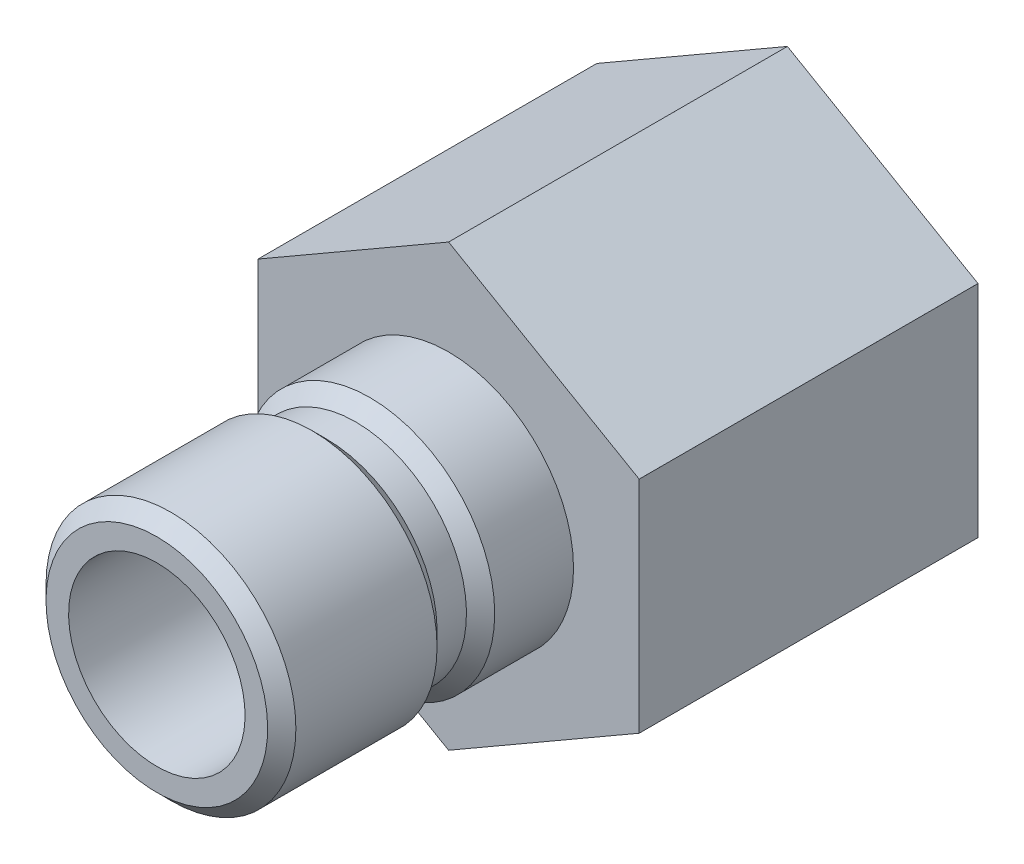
ISO-10303-21;
HEADER;
FILE_DESCRIPTION(('STEP AP214'),'2;1');
FILE_NAME('part.step','',(''),(''),'','','');
FILE_SCHEMA(('AUTOMOTIVE_DESIGN { 1 0 10303 214 1 1 1 1 }'));
ENDSEC;
DATA;
#1=APPLICATION_CONTEXT('core data for automotive mechanical design processes');
#2=APPLICATION_PROTOCOL_DEFINITION('international standard','automotive_design',2000,#1);
#3=PRODUCT_CONTEXT('',#1,'mechanical');
#4=PRODUCT('Part','Part','',(#3));
#5=PRODUCT_RELATED_PRODUCT_CATEGORY('part','',(#4));
#6=PRODUCT_DEFINITION_FORMATION('','',#4);
#7=PRODUCT_DEFINITION_CONTEXT('part definition',#1,'design');
#8=PRODUCT_DEFINITION('design','',#6,#7);
#9=PRODUCT_DEFINITION_SHAPE('','',#8);
#10=(LENGTH_UNIT() NAMED_UNIT(*) SI_UNIT(.MILLI.,.METRE.));
#11=(NAMED_UNIT(*) PLANE_ANGLE_UNIT() SI_UNIT($,.RADIAN.));
#12=(NAMED_UNIT(*) SI_UNIT($,.STERADIAN.) SOLID_ANGLE_UNIT());
#13=UNCERTAINTY_MEASURE_WITH_UNIT(LENGTH_MEASURE(1.E-05),#10,'distance_accuracy_value','');
#14=(GEOMETRIC_REPRESENTATION_CONTEXT(3) GLOBAL_UNCERTAINTY_ASSIGNED_CONTEXT((#13)) GLOBAL_UNIT_ASSIGNED_CONTEXT((#10,
#11,#12)) REPRESENTATION_CONTEXT('',''));
#15=CARTESIAN_POINT('',(0.,0.,0.));
#16=DIRECTION('',(0.,0.,1.));
#17=DIRECTION('',(1.,0.,0.));
#18=AXIS2_PLACEMENT_3D('',#15,#16,#17);
#19=CARTESIAN_POINT('',(0.,11.87831,-18.288));
#20=DIRECTION('',(0.,0.,-1.));
#21=DIRECTION('',(0.,1.,0.));
#22=AXIS2_PLACEMENT_3D('',#19,#20,#21);
#23=PLANE('',#22);
#24=CARTESIAN_POINT('',(0.,0.,-18.288));
#25=DIRECTION('',(0.,0.,-1.));
#26=DIRECTION('',(0.,1.,0.));
#27=AXIS2_PLACEMENT_3D('',#24,#25,#26);
#28=CIRCLE('',#27,6.81156341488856);
#29=CARTESIAN_POINT('',(0.,6.81156341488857,-18.288));
#30=VERTEX_POINT('',#29);
#31=EDGE_CURVE('E155',#30,#30,#28,.T.);
#32=ORIENTED_EDGE('',*,*,#31,.F.);
#33=EDGE_LOOP('',(#32));
#34=FACE_BOUND('',#33,.T.);
#35=CARTESIAN_POINT('',(0.,0.,-18.288));
#36=DIRECTION('',(0.,0.,-1.));
#37=DIRECTION('',(0.,1.,0.));
#38=AXIS2_PLACEMENT_3D('',#35,#36,#37);
#39=CIRCLE('',#38,11.87831);
#40=CARTESIAN_POINT('',(-10.287,5.93901334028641,-18.288));
#41=VERTEX_POINT('',#40);
#42=CARTESIAN_POINT('',(-10.2868364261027,5.93929665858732,-18.288));
#43=VERTEX_POINT('',#42);
#44=EDGE_CURVE('E136',#41,#43,#39,.T.);
#45=ORIENTED_EDGE('',*,*,#44,.T.);
#46=DIRECTION('',(-0.866025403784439,-0.5,0.));
#47=VECTOR('',#46,1.);
#48=CARTESIAN_POINT('',(0.,11.8784044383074,-18.288));
#49=LINE('',#48,#47);
#50=CARTESIAN_POINT('',(-0.000163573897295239,11.8783099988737,-18.288));
#51=VERTEX_POINT('',#50);
#52=EDGE_CURVE('E346',#51,#43,#49,.T.);
#53=ORIENTED_EDGE('',*,*,#52,.F.);
#54=CARTESIAN_POINT('',(0.00016357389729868,11.8783099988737,-18.288));
#55=VERTEX_POINT('',#54);
#56=EDGE_CURVE('E151',#51,#55,#39,.T.);
#57=ORIENTED_EDGE('',*,*,#56,.T.);
#58=DIRECTION('',(-0.866025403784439,0.5,0.));
#59=VECTOR('',#58,1.);
#60=CARTESIAN_POINT('',(10.287,5.93920221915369,-18.288));
#61=LINE('',#60,#59);
#62=CARTESIAN_POINT('',(10.2868364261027,5.93929665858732,-18.288));
#63=VERTEX_POINT('',#62);
#64=EDGE_CURVE('E305',#63,#55,#61,.T.);
#65=ORIENTED_EDGE('',*,*,#64,.F.);
#66=CARTESIAN_POINT('',(10.287,5.93901334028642,-18.288));
#67=VERTEX_POINT('',#66);
#68=EDGE_CURVE('E154',#63,#67,#39,.T.);
#69=ORIENTED_EDGE('',*,*,#68,.T.);
#70=DIRECTION('',(0.,1.,0.));
#71=VECTOR('',#70,1.);
#72=CARTESIAN_POINT('',(10.287,-5.93920221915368,-18.288));
#73=LINE('',#72,#71);
#74=CARTESIAN_POINT('',(10.287,-5.93901334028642,-18.288));
#75=VERTEX_POINT('',#74);
#76=EDGE_CURVE('E308',#75,#67,#73,.T.);
#77=ORIENTED_EDGE('',*,*,#76,.F.);
#78=CARTESIAN_POINT('',(10.2868364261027,-5.93929665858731,-18.288));
#79=VERTEX_POINT('',#78);
#80=EDGE_CURVE('E335',#75,#79,#39,.T.);
#81=ORIENTED_EDGE('',*,*,#80,.T.);
#82=DIRECTION('',(0.866025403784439,0.5,0.));
#83=VECTOR('',#82,1.);
#84=CARTESIAN_POINT('',(0.,-11.8784044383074,-18.288));
#85=LINE('',#84,#83);
#86=CARTESIAN_POINT('',(0.000163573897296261,-11.8783099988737,-18.288));
#87=VERTEX_POINT('',#86);
#88=EDGE_CURVE('E311',#87,#79,#85,.T.);
#89=ORIENTED_EDGE('',*,*,#88,.F.);
#90=CARTESIAN_POINT('',(-0.000163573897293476,-11.8783099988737,-18.288));
#91=VERTEX_POINT('',#90);
#92=EDGE_CURVE('E337',#87,#91,#39,.T.);
#93=ORIENTED_EDGE('',*,*,#92,.T.);
#94=DIRECTION('',(0.866025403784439,-0.5,0.));
#95=VECTOR('',#94,1.);
#96=CARTESIAN_POINT('',(-10.287,-5.93920221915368,-18.288));
#97=LINE('',#96,#95);
#98=CARTESIAN_POINT('',(-10.2868364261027,-5.93929665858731,-18.288));
#99=VERTEX_POINT('',#98);
#100=EDGE_CURVE('E348',#99,#91,#97,.T.);
#101=ORIENTED_EDGE('',*,*,#100,.F.);
#102=CARTESIAN_POINT('',(-10.287,-5.93901334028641,-18.288));
#103=VERTEX_POINT('',#102);
#104=EDGE_CURVE('E341',#99,#103,#39,.T.);
#105=ORIENTED_EDGE('',*,*,#104,.T.);
#106=DIRECTION('',(0.,-1.,0.));
#107=VECTOR('',#106,1.);
#108=CARTESIAN_POINT('',(-10.287,5.93920221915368,-18.288));
#109=LINE('',#108,#107);
#110=EDGE_CURVE('E347',#41,#103,#109,.T.);
#111=ORIENTED_EDGE('',*,*,#110,.F.);
#112=EDGE_LOOP('',(#45,#53,#57,#65,#69,#77,#81,#89,#93,#101,#105,#111));
#113=FACE_BOUND('',#112,.T.);
#114=ADVANCED_FACE('F33',(#34,#113),#23,.T.);
#115=CARTESIAN_POINT('',(0.,0.,0.));
#116=DIRECTION('',(0.,0.,-1.));
#117=DIRECTION('',(0.,1.,0.));
#118=AXIS2_PLACEMENT_3D('',#115,#116,#117);
#119=CYLINDRICAL_SURFACE('',#118,11.87831);
#120=ORIENTED_EDGE('',*,*,#56,.F.);
#121=DIRECTION('',(0.,0.,-1.));
#122=VECTOR('',#121,1.);
#123=CARTESIAN_POINT('',(-0.000163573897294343,11.8783099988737,0.));
#124=LINE('',#123,#122);
#125=CARTESIAN_POINT('',(-0.000163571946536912,11.87831,0.));
#126=VERTEX_POINT('',#125);
#127=EDGE_CURVE('E181',#51,#126,#124,.F.);
#128=ORIENTED_EDGE('',*,*,#127,.T.);
#129=CARTESIAN_POINT('',(0.,0.,0.));
#130=DIRECTION('',(0.,0.,-1.));
#131=DIRECTION('',(0.,1.,0.));
#132=AXIS2_PLACEMENT_3D('',#129,#130,#131);
#133=CIRCLE('',#132,11.87831);
#134=CARTESIAN_POINT('',(0.000163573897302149,11.8783099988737,0.));
#135=VERTEX_POINT('',#134);
#136=EDGE_CURVE('E142',#126,#135,#133,.T.);
#137=ORIENTED_EDGE('',*,*,#136,.T.);
#138=DIRECTION('',(0.,0.,-1.));
#139=VECTOR('',#138,1.);
#140=CARTESIAN_POINT('',(0.000163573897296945,11.8783099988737,0.));
#141=LINE('',#140,#139);
#142=EDGE_CURVE('E180',#135,#55,#141,.T.);
#143=ORIENTED_EDGE('',*,*,#142,.T.);
#144=EDGE_LOOP('',(#120,#128,#137,#143));
#145=FACE_BOUND('',#144,.T.);
#146=ADVANCED_FACE('F179',(#145),#119,.T.);
#147=CARTESIAN_POINT('',(-10.287,5.93901334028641,0.));
#148=VERTEX_POINT('',#147);
#149=CARTESIAN_POINT('',(-10.2868364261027,5.93929665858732,0.));
#150=VERTEX_POINT('',#149);
#151=EDGE_CURVE('E134',#148,#150,#133,.T.);
#152=ORIENTED_EDGE('',*,*,#151,.T.);
#153=DIRECTION('',(0.,0.,-1.));
#154=VECTOR('',#153,1.);
#155=CARTESIAN_POINT('',(-10.2868364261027,5.93929665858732,0.));
#156=LINE('',#155,#154);
#157=EDGE_CURVE('E48',#150,#43,#156,.T.);
#158=ORIENTED_EDGE('',*,*,#157,.T.);
#159=ORIENTED_EDGE('',*,*,#44,.F.);
#160=DIRECTION('',(0.,0.,-1.));
#161=VECTOR('',#160,1.);
#162=CARTESIAN_POINT('',(-10.287,5.93901334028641,0.));
#163=LINE('',#162,#161);
#164=EDGE_CURVE('E121',#41,#148,#163,.F.);
#165=ORIENTED_EDGE('',*,*,#164,.T.);
#166=EDGE_LOOP('',(#152,#158,#159,#165));
#167=FACE_BOUND('',#166,.T.);
#168=ADVANCED_FACE('F133',(#167),#119,.T.);
#169=ORIENTED_EDGE('',*,*,#68,.F.);
#170=DIRECTION('',(0.,0.,-1.));
#171=VECTOR('',#170,1.);
#172=CARTESIAN_POINT('',(10.2868364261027,5.93929665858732,0.));
#173=LINE('',#172,#171);
#174=CARTESIAN_POINT('',(10.2868364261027,5.93929665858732,0.));
#175=VERTEX_POINT('',#174);
#176=EDGE_CURVE('E188',#63,#175,#173,.F.);
#177=ORIENTED_EDGE('',*,*,#176,.T.);
#178=CARTESIAN_POINT('',(10.287,5.93901334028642,0.));
#179=VERTEX_POINT('',#178);
#180=EDGE_CURVE('E147',#175,#179,#133,.T.);
#181=ORIENTED_EDGE('',*,*,#180,.T.);
#182=DIRECTION('',(0.,0.,-1.));
#183=VECTOR('',#182,1.);
#184=CARTESIAN_POINT('',(10.287,5.93901334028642,0.));
#185=LINE('',#184,#183);
#186=EDGE_CURVE('E326',#179,#67,#185,.T.);
#187=ORIENTED_EDGE('',*,*,#186,.T.);
#188=EDGE_LOOP('',(#169,#177,#181,#187));
#189=FACE_BOUND('',#188,.T.);
#190=ADVANCED_FACE('F333',(#189),#119,.T.);
#191=ORIENTED_EDGE('',*,*,#80,.F.);
#192=DIRECTION('',(0.,0.,-1.));
#193=VECTOR('',#192,1.);
#194=CARTESIAN_POINT('',(10.287,-5.93901334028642,0.));
#195=LINE('',#194,#193);
#196=CARTESIAN_POINT('',(10.287,-5.93901334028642,0.));
#197=VERTEX_POINT('',#196);
#198=EDGE_CURVE('E329',#75,#197,#195,.F.);
#199=ORIENTED_EDGE('',*,*,#198,.T.);
#200=CARTESIAN_POINT('',(10.2868364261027,-5.93929665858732,0.));
#201=VERTEX_POINT('',#200);
#202=EDGE_CURVE('E356',#197,#201,#133,.T.);
#203=ORIENTED_EDGE('',*,*,#202,.T.);
#204=DIRECTION('',(0.,0.,-1.));
#205=VECTOR('',#204,1.);
#206=CARTESIAN_POINT('',(10.2868364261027,-5.93929665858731,0.));
#207=LINE('',#206,#205);
#208=EDGE_CURVE('E320',#201,#79,#207,.T.);
#209=ORIENTED_EDGE('',*,*,#208,.T.);
#210=EDGE_LOOP('',(#191,#199,#203,#209));
#211=FACE_BOUND('',#210,.T.);
#212=ADVANCED_FACE('F354',(#211),#119,.T.);
#213=ORIENTED_EDGE('',*,*,#92,.F.);
#214=DIRECTION('',(0.,0.,-1.));
#215=VECTOR('',#214,1.);
#216=CARTESIAN_POINT('',(0.000163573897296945,-11.8783099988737,0.));
#217=LINE('',#216,#215);
#218=CARTESIAN_POINT('',(0.000163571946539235,-11.87831,0.));
#219=VERTEX_POINT('',#218);
#220=EDGE_CURVE('E323',#87,#219,#217,.F.);
#221=ORIENTED_EDGE('',*,*,#220,.T.);
#222=CARTESIAN_POINT('',(-0.000163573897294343,-11.8783099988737,0.));
#223=VERTEX_POINT('',#222);
#224=EDGE_CURVE('E144',#219,#223,#133,.T.);
#225=ORIENTED_EDGE('',*,*,#224,.T.);
#226=DIRECTION('',(0.,0.,-1.));
#227=VECTOR('',#226,1.);
#228=CARTESIAN_POINT('',(-0.000163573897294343,-11.8783099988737,0.));
#229=LINE('',#228,#227);
#230=EDGE_CURVE('E137',#223,#91,#229,.T.);
#231=ORIENTED_EDGE('',*,*,#230,.T.);
#232=EDGE_LOOP('',(#213,#221,#225,#231));
#233=FACE_BOUND('',#232,.T.);
#234=ADVANCED_FACE('F360',(#233),#119,.T.);
#235=ORIENTED_EDGE('',*,*,#104,.F.);
#236=DIRECTION('',(0.,0.,-1.));
#237=VECTOR('',#236,1.);
#238=CARTESIAN_POINT('',(-10.2868364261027,-5.93929665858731,0.));
#239=LINE('',#238,#237);
#240=CARTESIAN_POINT('',(-10.2868364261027,-5.93929665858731,0.));
#241=VERTEX_POINT('',#240);
#242=EDGE_CURVE('E317',#99,#241,#239,.F.);
#243=ORIENTED_EDGE('',*,*,#242,.T.);
#244=CARTESIAN_POINT('',(-10.287,-5.93901334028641,0.));
#245=VERTEX_POINT('',#244);
#246=EDGE_CURVE('E141',#241,#245,#133,.T.);
#247=ORIENTED_EDGE('',*,*,#246,.T.);
#248=DIRECTION('',(0.,0.,-1.));
#249=VECTOR('',#248,1.);
#250=CARTESIAN_POINT('',(-10.287,-5.93901334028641,0.));
#251=LINE('',#250,#249);
#252=EDGE_CURVE('E55',#245,#103,#251,.T.);
#253=ORIENTED_EDGE('',*,*,#252,.T.);
#254=EDGE_LOOP('',(#235,#243,#247,#253));
#255=FACE_BOUND('',#254,.T.);
#256=ADVANCED_FACE('F236',(#255),#119,.T.);
#257=CARTESIAN_POINT('',(0.,6.7437,0.));
#258=DIRECTION('',(0.,0.,1.));
#259=DIRECTION('',(0.,-1.,0.));
#260=AXIS2_PLACEMENT_3D('',#257,#258,#259);
#261=PLANE('',#260);
#262=CARTESIAN_POINT('',(0.,0.,0.));
#263=DIRECTION('',(0.,0.,-1.));
#264=DIRECTION('',(0.,1.,0.));
#265=AXIS2_PLACEMENT_3D('',#262,#263,#264);
#266=CIRCLE('',#265,6.7437);
#267=CARTESIAN_POINT('',(0.,6.7437,0.));
#268=VERTEX_POINT('',#267);
#269=EDGE_CURVE('E146',#268,#268,#266,.T.);
#270=ORIENTED_EDGE('',*,*,#269,.T.);
#271=EDGE_LOOP('',(#270));
#272=FACE_BOUND('',#271,.T.);
#273=ORIENTED_EDGE('',*,*,#136,.F.);
#274=DIRECTION('',(-0.866025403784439,-0.5,0.));
#275=VECTOR('',#274,1.);
#276=CARTESIAN_POINT('',(-2.22339224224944,10.5947283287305,0.));
#277=LINE('',#276,#275);
#278=EDGE_CURVE('E12',#126,#150,#277,.T.);
#279=ORIENTED_EDGE('',*,*,#278,.T.);
#280=ORIENTED_EDGE('',*,*,#151,.F.);
#281=DIRECTION('',(0.,-1.,0.));
#282=VECTOR('',#281,1.);
#283=CARTESIAN_POINT('',(-10.287,6.7437,0.));
#284=LINE('',#283,#282);
#285=EDGE_CURVE('E118',#148,#245,#284,.T.);
#286=ORIENTED_EDGE('',*,*,#285,.T.);
#287=ORIENTED_EDGE('',*,*,#246,.F.);
#288=DIRECTION('',(0.866025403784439,-0.5,0.));
#289=VECTOR('',#288,1.);
#290=CARTESIAN_POINT('',(-8.06360775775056,-7.22287832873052,0.));
#291=LINE('',#290,#289);
#292=EDGE_CURVE('E127',#241,#223,#291,.T.);
#293=ORIENTED_EDGE('',*,*,#292,.T.);
#294=ORIENTED_EDGE('',*,*,#224,.F.);
#295=DIRECTION('',(0.866025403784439,0.5,0.));
#296=VECTOR('',#295,1.);
#297=CARTESIAN_POINT('',(8.06360775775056,-7.22287832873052,0.));
#298=LINE('',#297,#296);
#299=EDGE_CURVE('E165',#219,#201,#298,.T.);
#300=ORIENTED_EDGE('',*,*,#299,.T.);
#301=ORIENTED_EDGE('',*,*,#202,.F.);
#302=DIRECTION('',(0.,1.,0.));
#303=VECTOR('',#302,1.);
#304=CARTESIAN_POINT('',(10.287,6.7437,0.));
#305=LINE('',#304,#303);
#306=EDGE_CURVE('E168',#197,#179,#305,.T.);
#307=ORIENTED_EDGE('',*,*,#306,.T.);
#308=ORIENTED_EDGE('',*,*,#180,.F.);
#309=DIRECTION('',(-0.866025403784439,0.5,0.));
#310=VECTOR('',#309,1.);
#311=CARTESIAN_POINT('',(2.22339224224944,10.5947283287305,0.));
#312=LINE('',#311,#310);
#313=EDGE_CURVE('E41',#175,#135,#312,.T.);
#314=ORIENTED_EDGE('',*,*,#313,.T.);
#315=EDGE_LOOP('',(#273,#279,#280,#286,#287,#293,#294,#300,#301,#307,#308,#314));
#316=FACE_BOUND('',#315,.T.);
#317=ADVANCED_FACE('F140',(#272,#316),#261,.T.);
#318=CARTESIAN_POINT('',(0.,0.,0.));
#319=DIRECTION('',(0.,0.,-1.));
#320=DIRECTION('',(0.,1.,0.));
#321=AXIS2_PLACEMENT_3D('',#318,#319,#320);
#322=CYLINDRICAL_SURFACE('',#321,4.7625);
#323=CARTESIAN_POINT('',(0.,0.,-6.36270000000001));
#324=DIRECTION('',(0.,0.,-1.));
#325=DIRECTION('',(0.,1.,0.));
#326=AXIS2_PLACEMENT_3D('',#323,#324,#325);
#327=CIRCLE('',#326,4.7625);
#328=CARTESIAN_POINT('',(0.,4.7625,-6.36270000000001));
#329=VERTEX_POINT('',#328);
#330=EDGE_CURVE('E128',#329,#329,#327,.T.);
#331=ORIENTED_EDGE('',*,*,#330,.T.);
#332=EDGE_LOOP('',(#331));
#333=FACE_BOUND('',#332,.T.);
#334=CARTESIAN_POINT('',(0.,0.,15.748));
#335=DIRECTION('',(0.,0.,-1.));
#336=DIRECTION('',(0.,1.,0.));
#337=AXIS2_PLACEMENT_3D('',#334,#335,#336);
#338=CIRCLE('',#337,4.7625);
#339=CARTESIAN_POINT('',(0.,4.7625,15.748));
#340=VERTEX_POINT('',#339);
#341=EDGE_CURVE('E183',#340,#340,#338,.T.);
#342=ORIENTED_EDGE('',*,*,#341,.F.);
#343=EDGE_LOOP('',(#342));
#344=FACE_BOUND('',#343,.T.);
#345=ADVANCED_FACE('F35',(#333,#344),#322,.F.);
#346=CARTESIAN_POINT('',(0.,4.7625,-6.36270000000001));
#347=DIRECTION('',(0.,0.,-1.));
#348=DIRECTION('',(0.,1.,0.));
#349=AXIS2_PLACEMENT_3D('',#346,#347,#348);
#350=PLANE('',#349);
#351=CARTESIAN_POINT('',(0.,0.,-6.36270000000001));
#352=DIRECTION('',(0.,0.,-1.));
#353=DIRECTION('',(0.,1.,0.));
#354=AXIS2_PLACEMENT_3D('',#351,#352,#353);
#355=CIRCLE('',#354,6.4389);
#356=CARTESIAN_POINT('',(0.,6.4389,-6.36270000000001));
#357=VERTEX_POINT('',#356);
#358=EDGE_CURVE('E158',#357,#357,#355,.T.);
#359=ORIENTED_EDGE('',*,*,#358,.T.);
#360=EDGE_LOOP('',(#359));
#361=FACE_BOUND('',#360,.T.);
#362=ORIENTED_EDGE('',*,*,#330,.F.);
#363=EDGE_LOOP('',(#362));
#364=FACE_BOUND('',#363,.T.);
#365=ADVANCED_FACE('F225',(#361,#364),#350,.T.);
#366=CARTESIAN_POINT('',(0.,0.,-6.36270000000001));
#367=DIRECTION('',(0.,0.,-1.));
#368=DIRECTION('',(0.,1.,0.));
#369=AXIS2_PLACEMENT_3D('',#366,#367,#368);
#370=CONICAL_SURFACE('',#369,6.4389,0.0312396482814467);
#371=ORIENTED_EDGE('',*,*,#31,.T.);
#372=EDGE_LOOP('',(#371));
#373=FACE_BOUND('',#372,.T.);
#374=ORIENTED_EDGE('',*,*,#358,.F.);
#375=EDGE_LOOP('',(#374));
#376=FACE_BOUND('',#375,.T.);
#377=ADVANCED_FACE('F216',(#373,#376),#370,.F.);
#378=CARTESIAN_POINT('',(0.,0.,0.));
#379=DIRECTION('',(0.,0.,-1.));
#380=DIRECTION('',(0.,1.,0.));
#381=AXIS2_PLACEMENT_3D('',#378,#379,#380);
#382=CYLINDRICAL_SURFACE('',#381,6.7437);
#383=CARTESIAN_POINT('',(0.,0.,4.25449999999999));
#384=DIRECTION('',(0.,0.,-1.));
#385=DIRECTION('',(0.,1.,0.));
#386=AXIS2_PLACEMENT_3D('',#383,#384,#385);
#387=CIRCLE('',#386,6.7437);
#388=CARTESIAN_POINT('',(0.,6.7437,4.25449999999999));
#389=VERTEX_POINT('',#388);
#390=EDGE_CURVE('E205',#389,#389,#387,.T.);
#391=ORIENTED_EDGE('',*,*,#390,.T.);
#392=EDGE_LOOP('',(#391));
#393=FACE_BOUND('',#392,.T.);
#394=ORIENTED_EDGE('',*,*,#269,.F.);
#395=EDGE_LOOP('',(#394));
#396=FACE_BOUND('',#395,.T.);
#397=ADVANCED_FACE('F213',(#393,#396),#382,.T.);
#398=CARTESIAN_POINT('',(0.,0.,4.25449999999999));
#399=DIRECTION('',(0.,0.,-1.));
#400=DIRECTION('',(0.,1.,0.));
#401=AXIS2_PLACEMENT_3D('',#398,#399,#400);
#402=CONICAL_SURFACE('',#401,6.7437,0.785398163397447);
#403=CARTESIAN_POINT('',(0.,0.,5.0165));
#404=DIRECTION('',(0.,0.,-1.));
#405=DIRECTION('',(0.,1.,0.));
#406=AXIS2_PLACEMENT_3D('',#403,#404,#405);
#407=CIRCLE('',#406,5.9817);
#408=CARTESIAN_POINT('',(0.,5.9817,5.0165));
#409=VERTEX_POINT('',#408);
#410=EDGE_CURVE('E203',#409,#409,#407,.T.);
#411=ORIENTED_EDGE('',*,*,#410,.T.);
#412=EDGE_LOOP('',(#411));
#413=FACE_BOUND('',#412,.T.);
#414=ORIENTED_EDGE('',*,*,#390,.F.);
#415=EDGE_LOOP('',(#414));
#416=FACE_BOUND('',#415,.T.);
#417=ADVANCED_FACE('F215',(#413,#416),#402,.T.);
#418=CARTESIAN_POINT('',(0.,0.,0.));
#419=DIRECTION('',(0.,0.,-1.));
#420=DIRECTION('',(0.,1.,0.));
#421=AXIS2_PLACEMENT_3D('',#418,#419,#420);
#422=CYLINDRICAL_SURFACE('',#421,5.9817);
#423=CARTESIAN_POINT('',(0.,0.,6.604));
#424=DIRECTION('',(0.,0.,-1.));
#425=DIRECTION('',(0.,1.,0.));
#426=AXIS2_PLACEMENT_3D('',#423,#424,#425);
#427=CIRCLE('',#426,5.9817);
#428=CARTESIAN_POINT('',(0.,5.9817,6.604));
#429=VERTEX_POINT('',#428);
#430=EDGE_CURVE('E200',#429,#429,#427,.T.);
#431=ORIENTED_EDGE('',*,*,#430,.T.);
#432=EDGE_LOOP('',(#431));
#433=FACE_BOUND('',#432,.T.);
#434=ORIENTED_EDGE('',*,*,#410,.F.);
#435=EDGE_LOOP('',(#434));
#436=FACE_BOUND('',#435,.T.);
#437=ADVANCED_FACE('F222',(#433,#436),#422,.T.);
#438=CARTESIAN_POINT('',(0.,0.,6.604));
#439=DIRECTION('',(0.,0.,1.));
#440=DIRECTION('',(0.,-1.,0.));
#441=AXIS2_PLACEMENT_3D('',#438,#439,#440);
#442=CONICAL_SURFACE('',#441,5.9817,0.785398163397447);
#443=CARTESIAN_POINT('',(0.,0.,7.366));
#444=DIRECTION('',(0.,0.,-1.));
#445=DIRECTION('',(0.,1.,0.));
#446=AXIS2_PLACEMENT_3D('',#443,#444,#445);
#447=CIRCLE('',#446,6.7437);
#448=CARTESIAN_POINT('',(0.,6.7437,7.366));
#449=VERTEX_POINT('',#448);
#450=EDGE_CURVE('E197',#449,#449,#447,.T.);
#451=ORIENTED_EDGE('',*,*,#450,.T.);
#452=EDGE_LOOP('',(#451));
#453=FACE_BOUND('',#452,.T.);
#454=ORIENTED_EDGE('',*,*,#430,.F.);
#455=EDGE_LOOP('',(#454));
#456=FACE_BOUND('',#455,.T.);
#457=ADVANCED_FACE('F266',(#453,#456),#442,.T.);
#458=CARTESIAN_POINT('',(0.,0.,0.));
#459=DIRECTION('',(0.,0.,-1.));
#460=DIRECTION('',(0.,1.,0.));
#461=AXIS2_PLACEMENT_3D('',#458,#459,#460);
#462=CYLINDRICAL_SURFACE('',#461,6.7437);
#463=CARTESIAN_POINT('',(0.,0.,14.986));
#464=DIRECTION('',(0.,0.,-1.));
#465=DIRECTION('',(0.,1.,0.));
#466=AXIS2_PLACEMENT_3D('',#463,#464,#465);
#467=CIRCLE('',#466,6.7437);
#468=CARTESIAN_POINT('',(0.,6.7437,14.986));
#469=VERTEX_POINT('',#468);
#470=EDGE_CURVE('E194',#469,#469,#467,.T.);
#471=ORIENTED_EDGE('',*,*,#470,.T.);
#472=EDGE_LOOP('',(#471));
#473=FACE_BOUND('',#472,.T.);
#474=ORIENTED_EDGE('',*,*,#450,.F.);
#475=EDGE_LOOP('',(#474));
#476=FACE_BOUND('',#475,.T.);
#477=ADVANCED_FACE('F260',(#473,#476),#462,.T.);
#478=CARTESIAN_POINT('',(0.,0.,14.986));
#479=DIRECTION('',(0.,0.,-1.));
#480=DIRECTION('',(0.,1.,0.));
#481=AXIS2_PLACEMENT_3D('',#478,#479,#480);
#482=CONICAL_SURFACE('',#481,6.7437,0.785398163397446);
#483=CARTESIAN_POINT('',(0.,0.,15.748));
#484=DIRECTION('',(0.,0.,-1.));
#485=DIRECTION('',(0.,1.,0.));
#486=AXIS2_PLACEMENT_3D('',#483,#484,#485);
#487=CIRCLE('',#486,5.9817);
#488=CARTESIAN_POINT('',(0.,5.9817,15.748));
#489=VERTEX_POINT('',#488);
#490=EDGE_CURVE('E186',#489,#489,#487,.T.);
#491=ORIENTED_EDGE('',*,*,#490,.T.);
#492=EDGE_LOOP('',(#491));
#493=FACE_BOUND('',#492,.T.);
#494=ORIENTED_EDGE('',*,*,#470,.F.);
#495=EDGE_LOOP('',(#494));
#496=FACE_BOUND('',#495,.T.);
#497=ADVANCED_FACE('F254',(#493,#496),#482,.T.);
#498=CARTESIAN_POINT('',(0.,4.7625,15.748));
#499=DIRECTION('',(0.,0.,1.));
#500=DIRECTION('',(0.,-1.,0.));
#501=AXIS2_PLACEMENT_3D('',#498,#499,#500);
#502=PLANE('',#501);
#503=ORIENTED_EDGE('',*,*,#341,.T.);
#504=EDGE_LOOP('',(#503));
#505=FACE_BOUND('',#504,.T.);
#506=ORIENTED_EDGE('',*,*,#490,.F.);
#507=EDGE_LOOP('',(#506));
#508=FACE_BOUND('',#507,.T.);
#509=ADVANCED_FACE('F251',(#505,#508),#502,.T.);
#510=CARTESIAN_POINT('',(-10.287,5.93920221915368,-18.288));
#511=DIRECTION('',(-1.,0.,0.));
#512=DIRECTION('',(0.,0.,1.));
#513=AXIS2_PLACEMENT_3D('',#510,#511,#512);
#514=PLANE('',#513);
#515=ORIENTED_EDGE('',*,*,#110,.T.);
#516=ORIENTED_EDGE('',*,*,#252,.F.);
#517=ORIENTED_EDGE('',*,*,#285,.F.);
#518=ORIENTED_EDGE('',*,*,#164,.F.);
#519=EDGE_LOOP('',(#515,#516,#517,#518));
#520=FACE_BOUND('',#519,.T.);
#521=ADVANCED_FACE('F120',(#520),#514,.T.);
#522=CARTESIAN_POINT('',(-10.287,-5.93920221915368,-18.288));
#523=DIRECTION('',(-0.5,-0.866025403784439,0.));
#524=DIRECTION('',(0.866025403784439,-0.5,0.));
#525=AXIS2_PLACEMENT_3D('',#522,#523,#524);
#526=PLANE('',#525);
#527=ORIENTED_EDGE('',*,*,#100,.T.);
#528=ORIENTED_EDGE('',*,*,#230,.F.);
#529=ORIENTED_EDGE('',*,*,#292,.F.);
#530=ORIENTED_EDGE('',*,*,#242,.F.);
#531=EDGE_LOOP('',(#527,#528,#529,#530));
#532=FACE_BOUND('',#531,.T.);
#533=ADVANCED_FACE('F289',(#532),#526,.T.);
#534=CARTESIAN_POINT('',(0.,-11.8784044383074,-18.288));
#535=DIRECTION('',(0.5,-0.866025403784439,0.));
#536=DIRECTION('',(0.866025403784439,0.5,0.));
#537=AXIS2_PLACEMENT_3D('',#534,#535,#536);
#538=PLANE('',#537);
#539=ORIENTED_EDGE('',*,*,#88,.T.);
#540=ORIENTED_EDGE('',*,*,#208,.F.);
#541=ORIENTED_EDGE('',*,*,#299,.F.);
#542=ORIENTED_EDGE('',*,*,#220,.F.);
#543=EDGE_LOOP('',(#539,#540,#541,#542));
#544=FACE_BOUND('',#543,.T.);
#545=ADVANCED_FACE('F292',(#544),#538,.T.);
#546=CARTESIAN_POINT('',(10.287,-5.93920221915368,-18.288));
#547=DIRECTION('',(1.,0.,0.));
#548=DIRECTION('',(0.,0.,-1.));
#549=AXIS2_PLACEMENT_3D('',#546,#547,#548);
#550=PLANE('',#549);
#551=ORIENTED_EDGE('',*,*,#76,.T.);
#552=ORIENTED_EDGE('',*,*,#186,.F.);
#553=ORIENTED_EDGE('',*,*,#306,.F.);
#554=ORIENTED_EDGE('',*,*,#198,.F.);
#555=EDGE_LOOP('',(#551,#552,#553,#554));
#556=FACE_BOUND('',#555,.T.);
#557=ADVANCED_FACE('F296',(#556),#550,.T.);
#558=CARTESIAN_POINT('',(10.287,5.93920221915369,-18.288));
#559=DIRECTION('',(0.5,0.866025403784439,0.));
#560=DIRECTION('',(-0.866025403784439,0.5,0.));
#561=AXIS2_PLACEMENT_3D('',#558,#559,#560);
#562=PLANE('',#561);
#563=ORIENTED_EDGE('',*,*,#64,.T.);
#564=ORIENTED_EDGE('',*,*,#142,.F.);
#565=ORIENTED_EDGE('',*,*,#313,.F.);
#566=ORIENTED_EDGE('',*,*,#176,.F.);
#567=EDGE_LOOP('',(#563,#564,#565,#566));
#568=FACE_BOUND('',#567,.T.);
#569=ADVANCED_FACE('F286',(#568),#562,.T.);
#570=CARTESIAN_POINT('',(0.,11.8784044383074,-18.288));
#571=DIRECTION('',(-0.5,0.866025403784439,0.));
#572=DIRECTION('',(-0.866025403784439,-0.5,0.));
#573=AXIS2_PLACEMENT_3D('',#570,#571,#572);
#574=PLANE('',#573);
#575=ORIENTED_EDGE('',*,*,#52,.T.);
#576=ORIENTED_EDGE('',*,*,#157,.F.);
#577=ORIENTED_EDGE('',*,*,#278,.F.);
#578=ORIENTED_EDGE('',*,*,#127,.F.);
#579=EDGE_LOOP('',(#575,#576,#577,#578));
#580=FACE_BOUND('',#579,.T.);
#581=ADVANCED_FACE('F283',(#580),#574,.T.);
#582=CLOSED_SHELL('',(#114,#146,#168,#190,#212,#234,#256,#317,#345,#365,#377,#397,#417,#437,
#457,#477,#497,#509,#521,#533,#545,#557,#569,#581));
#583=MANIFOLD_SOLID_BREP('B2',#582);
#584=ADVANCED_BREP_SHAPE_REPRESENTATION('',(#18,#583),#14);
#585=SHAPE_DEFINITION_REPRESENTATION(#9,#584);
ENDSEC;
END-ISO-10303-21;
